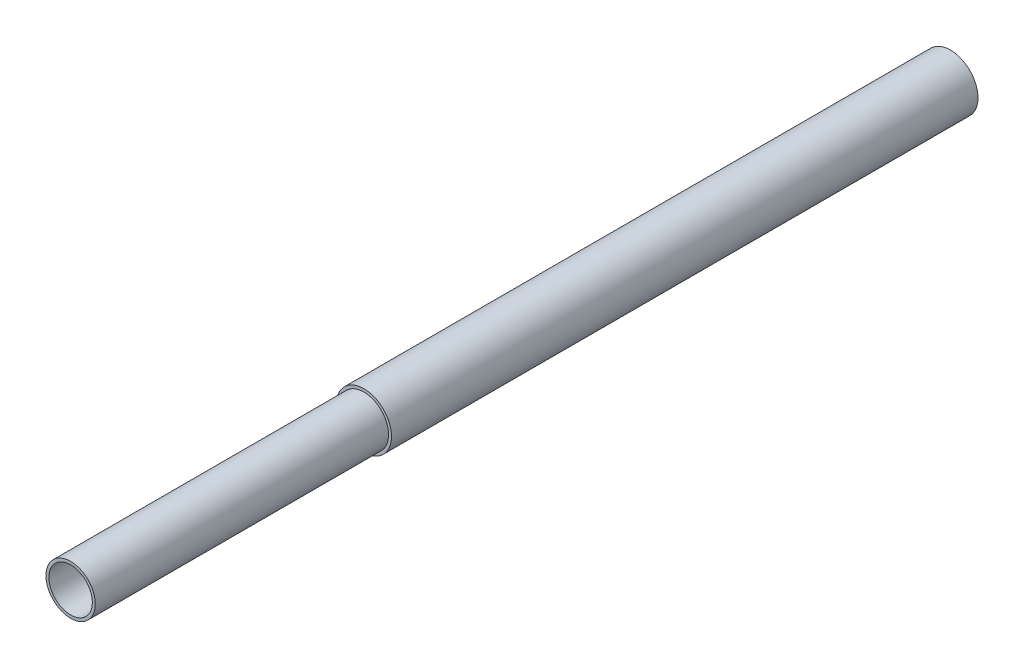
from build123d import *

# Parameters (mm, degrees)
SKETCH1_R      = 2.39014
EXTRUDE2_DEPTH = 50.8
SKETCH2_R      = 2.13614
EXTRUDE3_DEPTH = 25.4
EXTRUDE5_START = 76.2
SKETCH3_R      = 1.88214
EXTRUDE5_DEPTH = 50.8


with BuildPart() as part:
    # Sketch1 → Extrude2 (new body)
    with BuildSketch(Plane.XY):
        Circle(SKETCH1_R)
    extrude(amount=EXTRUDE2_DEPTH)

    # Sketch2 → Extrude3 (add)
    with BuildSketch(Plane.XY.offset(50.8)):
        Circle(SKETCH2_R)
    extrude(amount=EXTRUDE3_DEPTH)

    # Sketch3 → Extrude5 (cut)
    with BuildSketch(Plane.XY.offset(EXTRUDE5_START)):
        Circle(SKETCH3_R)
    extrude(amount=-EXTRUDE5_DEPTH, mode=Mode.SUBTRACT)


solid = part.part
